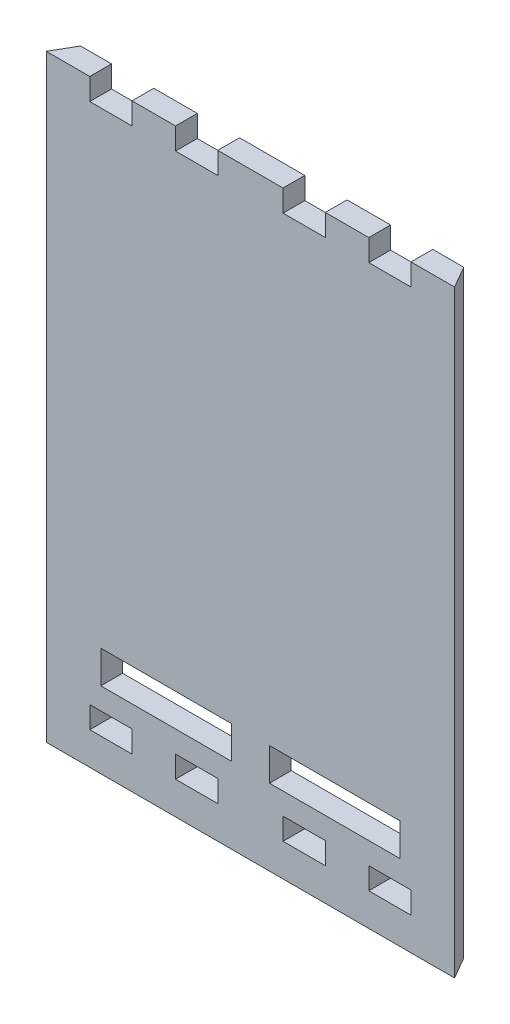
ISO-10303-21;
HEADER;
FILE_DESCRIPTION(('STEP AP214'),'2;1');
FILE_NAME('part.step','',(''),(''),'','','');
FILE_SCHEMA(('AUTOMOTIVE_DESIGN { 1 0 10303 214 1 1 1 1 }'));
ENDSEC;
DATA;
#1=APPLICATION_CONTEXT('core data for automotive mechanical design processes');
#2=APPLICATION_PROTOCOL_DEFINITION('international standard','automotive_design',2000,#1);
#3=PRODUCT_CONTEXT('',#1,'mechanical');
#4=PRODUCT('Part','Part','',(#3));
#5=PRODUCT_RELATED_PRODUCT_CATEGORY('part','',(#4));
#6=PRODUCT_DEFINITION_FORMATION('','',#4);
#7=PRODUCT_DEFINITION_CONTEXT('part definition',#1,'design');
#8=PRODUCT_DEFINITION('design','',#6,#7);
#9=PRODUCT_DEFINITION_SHAPE('','',#8);
#10=(LENGTH_UNIT() NAMED_UNIT(*) SI_UNIT(.MILLI.,.METRE.));
#11=(NAMED_UNIT(*) PLANE_ANGLE_UNIT() SI_UNIT($,.RADIAN.));
#12=(NAMED_UNIT(*) SI_UNIT($,.STERADIAN.) SOLID_ANGLE_UNIT());
#13=UNCERTAINTY_MEASURE_WITH_UNIT(LENGTH_MEASURE(1.E-05),#10,'distance_accuracy_value','');
#14=(GEOMETRIC_REPRESENTATION_CONTEXT(3) GLOBAL_UNCERTAINTY_ASSIGNED_CONTEXT((#13)) GLOBAL_UNIT_ASSIGNED_CONTEXT((#10,
#11,#12)) REPRESENTATION_CONTEXT('',''));
#15=CARTESIAN_POINT('',(0.,0.,0.));
#16=DIRECTION('',(0.,0.,1.));
#17=DIRECTION('',(1.,0.,0.));
#18=AXIS2_PLACEMENT_3D('',#15,#16,#17);
#19=CARTESIAN_POINT('',(0.,-2.,2.));
#20=DIRECTION('',(0.,1.,0.));
#21=DIRECTION('',(0.,0.,1.));
#22=AXIS2_PLACEMENT_3D('',#19,#20,#21);
#23=PLANE('',#22);
#24=DIRECTION('',(1.,0.,0.));
#25=VECTOR('',#24,1.);
#26=CARTESIAN_POINT('',(0.,-2.,0.));
#27=LINE('',#26,#25);
#28=CARTESIAN_POINT('',(3.99999999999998,-2.,0.));
#29=VERTEX_POINT('',#28);
#30=CARTESIAN_POINT('',(7.88194187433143,-2.,0.));
#31=VERTEX_POINT('',#30);
#32=EDGE_CURVE('E571',#29,#31,#27,.T.);
#33=ORIENTED_EDGE('',*,*,#32,.F.);
#34=DIRECTION('',(0.,0.,-1.));
#35=VECTOR('',#34,1.);
#36=CARTESIAN_POINT('',(3.99999999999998,-2.,2.));
#37=LINE('',#36,#35);
#38=CARTESIAN_POINT('',(3.99999999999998,-2.,2.));
#39=VERTEX_POINT('',#38);
#40=EDGE_CURVE('E11',#39,#29,#37,.T.);
#41=ORIENTED_EDGE('',*,*,#40,.F.);
#42=DIRECTION('',(1.,0.,0.));
#43=VECTOR('',#42,1.);
#44=CARTESIAN_POINT('',(0.,-2.,2.));
#45=LINE('',#44,#43);
#46=CARTESIAN_POINT('',(7.88194187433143,-2.,2.));
#47=VERTEX_POINT('',#46);
#48=EDGE_CURVE('E481',#39,#47,#45,.T.);
#49=ORIENTED_EDGE('',*,*,#48,.T.);
#50=DIRECTION('',(0.,0.,-1.));
#51=VECTOR('',#50,1.);
#52=CARTESIAN_POINT('',(7.88194187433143,-2.,2.));
#53=LINE('',#52,#51);
#54=EDGE_CURVE('E582',#47,#31,#53,.T.);
#55=ORIENTED_EDGE('',*,*,#54,.T.);
#56=EDGE_LOOP('',(#33,#41,#49,#55));
#57=FACE_BOUND('',#56,.T.);
#58=ADVANCED_FACE('F35',(#57),#23,.T.);
#59=CARTESIAN_POINT('',(3.99999999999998,0.,2.));
#60=DIRECTION('',(1.,0.,0.));
#61=DIRECTION('',(0.,1.,0.));
#62=AXIS2_PLACEMENT_3D('',#59,#60,#61);
#63=PLANE('',#62);
#64=DIRECTION('',(0.,-1.,0.));
#65=VECTOR('',#64,1.);
#66=CARTESIAN_POINT('',(3.99999999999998,0.,0.));
#67=LINE('',#66,#65);
#68=CARTESIAN_POINT('',(3.99999999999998,0.,0.));
#69=VERTEX_POINT('',#68);
#70=EDGE_CURVE('E574',#69,#29,#67,.T.);
#71=ORIENTED_EDGE('',*,*,#70,.F.);
#72=DIRECTION('',(0.,0.,-1.));
#73=VECTOR('',#72,1.);
#74=CARTESIAN_POINT('',(3.99999999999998,0.,2.));
#75=LINE('',#74,#73);
#76=CARTESIAN_POINT('',(3.99999999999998,0.,2.));
#77=VERTEX_POINT('',#76);
#78=EDGE_CURVE('E44',#77,#69,#75,.T.);
#79=ORIENTED_EDGE('',*,*,#78,.F.);
#80=DIRECTION('',(0.,-1.,0.));
#81=VECTOR('',#80,1.);
#82=CARTESIAN_POINT('',(3.99999999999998,0.,2.));
#83=LINE('',#82,#81);
#84=EDGE_CURVE('E484',#77,#39,#83,.T.);
#85=ORIENTED_EDGE('',*,*,#84,.T.);
#86=ORIENTED_EDGE('',*,*,#40,.T.);
#87=EDGE_LOOP('',(#71,#79,#85,#86));
#88=FACE_BOUND('',#87,.T.);
#89=ADVANCED_FACE('F747',(#88),#63,.T.);
#90=CARTESIAN_POINT('',(0.,0.,2.));
#91=DIRECTION('',(0.,1.,0.));
#92=DIRECTION('',(0.,0.,1.));
#93=AXIS2_PLACEMENT_3D('',#90,#91,#92);
#94=PLANE('',#93);
#95=DIRECTION('',(1.,0.,0.));
#96=VECTOR('',#95,1.);
#97=CARTESIAN_POINT('',(0.,0.,0.));
#98=LINE('',#97,#96);
#99=CARTESIAN_POINT('',(7.88194187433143,0.,0.));
#100=VERTEX_POINT('',#99);
#101=EDGE_CURVE('E577',#69,#100,#98,.T.);
#102=ORIENTED_EDGE('',*,*,#101,.T.);
#103=DIRECTION('',(0.,0.,-1.));
#104=VECTOR('',#103,1.);
#105=CARTESIAN_POINT('',(7.88194187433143,0.,2.));
#106=LINE('',#105,#104);
#107=CARTESIAN_POINT('',(7.88194187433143,0.,2.));
#108=VERTEX_POINT('',#107);
#109=EDGE_CURVE('E584',#108,#100,#106,.T.);
#110=ORIENTED_EDGE('',*,*,#109,.F.);
#111=DIRECTION('',(1.,0.,0.));
#112=VECTOR('',#111,1.);
#113=CARTESIAN_POINT('',(0.,0.,2.));
#114=LINE('',#113,#112);
#115=EDGE_CURVE('E487',#77,#108,#114,.T.);
#116=ORIENTED_EDGE('',*,*,#115,.F.);
#117=ORIENTED_EDGE('',*,*,#78,.T.);
#118=EDGE_LOOP('',(#102,#110,#116,#117));
#119=FACE_BOUND('',#118,.T.);
#120=ADVANCED_FACE('F753',(#119),#94,.F.);
#121=CARTESIAN_POINT('',(0.,-2.,2.));
#122=DIRECTION('',(0.,1.,0.));
#123=DIRECTION('',(0.,0.,1.));
#124=AXIS2_PLACEMENT_3D('',#121,#122,#123);
#125=PLANE('',#124);
#126=DIRECTION('',(1.,0.,0.));
#127=VECTOR('',#126,1.);
#128=CARTESIAN_POINT('',(0.,-2.,0.));
#129=LINE('',#128,#127);
#130=CARTESIAN_POINT('',(11.8819418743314,-2.,0.));
#131=VERTEX_POINT('',#130);
#132=CARTESIAN_POINT('',(15.7638837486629,-2.,0.));
#133=VERTEX_POINT('',#132);
#134=EDGE_CURVE('E559',#131,#133,#129,.T.);
#135=ORIENTED_EDGE('',*,*,#134,.F.);
#136=DIRECTION('',(0.,0.,-1.));
#137=VECTOR('',#136,1.);
#138=CARTESIAN_POINT('',(11.8819418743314,-2.,2.));
#139=LINE('',#138,#137);
#140=CARTESIAN_POINT('',(11.8819418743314,-2.,2.));
#141=VERTEX_POINT('',#140);
#142=EDGE_CURVE('E585',#141,#131,#139,.T.);
#143=ORIENTED_EDGE('',*,*,#142,.F.);
#144=DIRECTION('',(1.,0.,0.));
#145=VECTOR('',#144,1.);
#146=CARTESIAN_POINT('',(0.,-2.,2.));
#147=LINE('',#146,#145);
#148=CARTESIAN_POINT('',(15.7638837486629,-2.,2.));
#149=VERTEX_POINT('',#148);
#150=EDGE_CURVE('E470',#141,#149,#147,.T.);
#151=ORIENTED_EDGE('',*,*,#150,.T.);
#152=DIRECTION('',(0.,0.,-1.));
#153=VECTOR('',#152,1.);
#154=CARTESIAN_POINT('',(15.7638837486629,-2.,2.));
#155=LINE('',#154,#153);
#156=EDGE_CURVE('E589',#149,#133,#155,.T.);
#157=ORIENTED_EDGE('',*,*,#156,.T.);
#158=EDGE_LOOP('',(#135,#143,#151,#157));
#159=FACE_BOUND('',#158,.T.);
#160=ADVANCED_FACE('F767',(#159),#125,.T.);
#161=CARTESIAN_POINT('',(11.8819418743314,0.,2.));
#162=DIRECTION('',(1.,0.,0.));
#163=DIRECTION('',(0.,1.,0.));
#164=AXIS2_PLACEMENT_3D('',#161,#162,#163);
#165=PLANE('',#164);
#166=DIRECTION('',(0.,-1.,0.));
#167=VECTOR('',#166,1.);
#168=CARTESIAN_POINT('',(11.8819418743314,0.,0.));
#169=LINE('',#168,#167);
#170=CARTESIAN_POINT('',(11.8819418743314,0.,0.));
#171=VERTEX_POINT('',#170);
#172=EDGE_CURVE('E562',#171,#131,#169,.T.);
#173=ORIENTED_EDGE('',*,*,#172,.F.);
#174=DIRECTION('',(0.,0.,-1.));
#175=VECTOR('',#174,1.);
#176=CARTESIAN_POINT('',(11.8819418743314,0.,2.));
#177=LINE('',#176,#175);
#178=CARTESIAN_POINT('',(11.8819418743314,0.,2.));
#179=VERTEX_POINT('',#178);
#180=EDGE_CURVE('E595',#179,#171,#177,.T.);
#181=ORIENTED_EDGE('',*,*,#180,.F.);
#182=DIRECTION('',(0.,-1.,0.));
#183=VECTOR('',#182,1.);
#184=CARTESIAN_POINT('',(11.8819418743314,0.,2.));
#185=LINE('',#184,#183);
#186=EDGE_CURVE('E473',#179,#141,#185,.T.);
#187=ORIENTED_EDGE('',*,*,#186,.T.);
#188=ORIENTED_EDGE('',*,*,#142,.T.);
#189=EDGE_LOOP('',(#173,#181,#187,#188));
#190=FACE_BOUND('',#189,.T.);
#191=ADVANCED_FACE('F763',(#190),#165,.T.);
#192=CARTESIAN_POINT('',(0.,0.,2.));
#193=DIRECTION('',(0.,1.,0.));
#194=DIRECTION('',(0.,0.,1.));
#195=AXIS2_PLACEMENT_3D('',#192,#193,#194);
#196=PLANE('',#195);
#197=DIRECTION('',(1.,0.,0.));
#198=VECTOR('',#197,1.);
#199=CARTESIAN_POINT('',(0.,0.,0.));
#200=LINE('',#199,#198);
#201=CARTESIAN_POINT('',(15.7638837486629,0.,0.));
#202=VERTEX_POINT('',#201);
#203=EDGE_CURVE('E565',#171,#202,#200,.T.);
#204=ORIENTED_EDGE('',*,*,#203,.T.);
#205=DIRECTION('',(0.,0.,-1.));
#206=VECTOR('',#205,1.);
#207=CARTESIAN_POINT('',(15.7638837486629,0.,2.));
#208=LINE('',#207,#206);
#209=CARTESIAN_POINT('',(15.7638837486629,0.,2.));
#210=VERTEX_POINT('',#209);
#211=EDGE_CURVE('E591',#210,#202,#208,.T.);
#212=ORIENTED_EDGE('',*,*,#211,.F.);
#213=DIRECTION('',(1.,0.,0.));
#214=VECTOR('',#213,1.);
#215=CARTESIAN_POINT('',(0.,0.,2.));
#216=LINE('',#215,#214);
#217=EDGE_CURVE('E476',#179,#210,#216,.T.);
#218=ORIENTED_EDGE('',*,*,#217,.F.);
#219=ORIENTED_EDGE('',*,*,#180,.T.);
#220=EDGE_LOOP('',(#204,#212,#218,#219));
#221=FACE_BOUND('',#220,.T.);
#222=ADVANCED_FACE('F759',(#221),#196,.F.);
#223=CARTESIAN_POINT('',(0.,-2.,2.));
#224=DIRECTION('',(0.,1.,0.));
#225=DIRECTION('',(0.,0.,1.));
#226=AXIS2_PLACEMENT_3D('',#223,#224,#225);
#227=PLANE('',#226);
#228=DIRECTION('',(1.,0.,0.));
#229=VECTOR('',#228,1.);
#230=CARTESIAN_POINT('',(0.,-2.,0.));
#231=LINE('',#230,#229);
#232=CARTESIAN_POINT('',(21.7638837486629,-2.,0.));
#233=VERTEX_POINT('',#232);
#234=CARTESIAN_POINT('',(25.6458256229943,-2.,0.));
#235=VERTEX_POINT('',#234);
#236=EDGE_CURVE('E547',#233,#235,#231,.T.);
#237=ORIENTED_EDGE('',*,*,#236,.F.);
#238=DIRECTION('',(0.,0.,-1.));
#239=VECTOR('',#238,1.);
#240=CARTESIAN_POINT('',(21.7638837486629,-2.,2.));
#241=LINE('',#240,#239);
#242=CARTESIAN_POINT('',(21.7638837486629,-2.,2.));
#243=VERTEX_POINT('',#242);
#244=EDGE_CURVE('E592',#243,#233,#241,.T.);
#245=ORIENTED_EDGE('',*,*,#244,.F.);
#246=DIRECTION('',(1.,0.,0.));
#247=VECTOR('',#246,1.);
#248=CARTESIAN_POINT('',(0.,-2.,2.));
#249=LINE('',#248,#247);
#250=CARTESIAN_POINT('',(25.6458256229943,-2.,2.));
#251=VERTEX_POINT('',#250);
#252=EDGE_CURVE('E459',#243,#251,#249,.T.);
#253=ORIENTED_EDGE('',*,*,#252,.T.);
#254=DIRECTION('',(0.,0.,-1.));
#255=VECTOR('',#254,1.);
#256=CARTESIAN_POINT('',(25.6458256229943,-2.,2.));
#257=LINE('',#256,#255);
#258=EDGE_CURVE('E598',#251,#235,#257,.T.);
#259=ORIENTED_EDGE('',*,*,#258,.T.);
#260=EDGE_LOOP('',(#237,#245,#253,#259));
#261=FACE_BOUND('',#260,.T.);
#262=ADVANCED_FACE('F762',(#261),#227,.T.);
#263=CARTESIAN_POINT('',(21.7638837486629,0.,2.));
#264=DIRECTION('',(1.,0.,0.));
#265=DIRECTION('',(0.,0.,-1.));
#266=AXIS2_PLACEMENT_3D('',#263,#264,#265);
#267=PLANE('',#266);
#268=DIRECTION('',(0.,-1.,0.));
#269=VECTOR('',#268,1.);
#270=CARTESIAN_POINT('',(21.7638837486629,0.,0.));
#271=LINE('',#270,#269);
#272=CARTESIAN_POINT('',(21.7638837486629,0.,0.));
#273=VERTEX_POINT('',#272);
#274=EDGE_CURVE('E550',#273,#233,#271,.T.);
#275=ORIENTED_EDGE('',*,*,#274,.F.);
#276=DIRECTION('',(0.,0.,-1.));
#277=VECTOR('',#276,1.);
#278=CARTESIAN_POINT('',(21.7638837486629,0.,2.));
#279=LINE('',#278,#277);
#280=CARTESIAN_POINT('',(21.7638837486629,0.,2.));
#281=VERTEX_POINT('',#280);
#282=EDGE_CURVE('E603',#281,#273,#279,.T.);
#283=ORIENTED_EDGE('',*,*,#282,.F.);
#284=DIRECTION('',(0.,-1.,0.));
#285=VECTOR('',#284,1.);
#286=CARTESIAN_POINT('',(21.7638837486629,0.,2.));
#287=LINE('',#286,#285);
#288=EDGE_CURVE('E462',#281,#243,#287,.T.);
#289=ORIENTED_EDGE('',*,*,#288,.T.);
#290=ORIENTED_EDGE('',*,*,#244,.T.);
#291=EDGE_LOOP('',(#275,#283,#289,#290));
#292=FACE_BOUND('',#291,.T.);
#293=ADVANCED_FACE('F780',(#292),#267,.T.);
#294=CARTESIAN_POINT('',(0.,0.,2.));
#295=DIRECTION('',(0.,-1.,0.));
#296=DIRECTION('',(0.,0.,-1.));
#297=AXIS2_PLACEMENT_3D('',#294,#295,#296);
#298=PLANE('',#297);
#299=DIRECTION('',(-1.,0.,0.));
#300=VECTOR('',#299,1.);
#301=CARTESIAN_POINT('',(0.,0.,0.));
#302=LINE('',#301,#300);
#303=CARTESIAN_POINT('',(25.6458256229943,0.,0.));
#304=VERTEX_POINT('',#303);
#305=EDGE_CURVE('E553',#304,#273,#302,.T.);
#306=ORIENTED_EDGE('',*,*,#305,.F.);
#307=DIRECTION('',(0.,0.,-1.));
#308=VECTOR('',#307,1.);
#309=CARTESIAN_POINT('',(25.6458256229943,0.,2.));
#310=LINE('',#309,#308);
#311=CARTESIAN_POINT('',(25.6458256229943,0.,2.));
#312=VERTEX_POINT('',#311);
#313=EDGE_CURVE('E600',#312,#304,#310,.T.);
#314=ORIENTED_EDGE('',*,*,#313,.F.);
#315=DIRECTION('',(-1.,0.,0.));
#316=VECTOR('',#315,1.);
#317=CARTESIAN_POINT('',(0.,0.,2.));
#318=LINE('',#317,#316);
#319=EDGE_CURVE('E465',#312,#281,#318,.T.);
#320=ORIENTED_EDGE('',*,*,#319,.T.);
#321=ORIENTED_EDGE('',*,*,#282,.T.);
#322=EDGE_LOOP('',(#306,#314,#320,#321));
#323=FACE_BOUND('',#322,.T.);
#324=ADVANCED_FACE('F776',(#323),#298,.T.);
#325=CARTESIAN_POINT('',(0.,-2.,2.));
#326=DIRECTION('',(0.,1.,0.));
#327=DIRECTION('',(0.,0.,1.));
#328=AXIS2_PLACEMENT_3D('',#325,#326,#327);
#329=PLANE('',#328);
#330=DIRECTION('',(1.,0.,0.));
#331=VECTOR('',#330,1.);
#332=CARTESIAN_POINT('',(0.,-2.,0.));
#333=LINE('',#332,#331);
#334=CARTESIAN_POINT('',(29.6458256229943,-2.,0.));
#335=VERTEX_POINT('',#334);
#336=CARTESIAN_POINT('',(33.5277674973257,-2.,0.));
#337=VERTEX_POINT('',#336);
#338=EDGE_CURVE('E535',#335,#337,#333,.T.);
#339=ORIENTED_EDGE('',*,*,#338,.F.);
#340=DIRECTION('',(0.,0.,-1.));
#341=VECTOR('',#340,1.);
#342=CARTESIAN_POINT('',(29.6458256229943,-2.,2.));
#343=LINE('',#342,#341);
#344=CARTESIAN_POINT('',(29.6458256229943,-2.,2.));
#345=VERTEX_POINT('',#344);
#346=EDGE_CURVE('E601',#345,#335,#343,.T.);
#347=ORIENTED_EDGE('',*,*,#346,.F.);
#348=DIRECTION('',(1.,0.,0.));
#349=VECTOR('',#348,1.);
#350=CARTESIAN_POINT('',(0.,-2.,2.));
#351=LINE('',#350,#349);
#352=CARTESIAN_POINT('',(33.5277674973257,-2.,2.));
#353=VERTEX_POINT('',#352);
#354=EDGE_CURVE('E448',#345,#353,#351,.T.);
#355=ORIENTED_EDGE('',*,*,#354,.T.);
#356=DIRECTION('',(0.,0.,-1.));
#357=VECTOR('',#356,1.);
#358=CARTESIAN_POINT('',(33.5277674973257,-2.,2.));
#359=LINE('',#358,#357);
#360=EDGE_CURVE('E606',#353,#337,#359,.T.);
#361=ORIENTED_EDGE('',*,*,#360,.T.);
#362=EDGE_LOOP('',(#339,#347,#355,#361));
#363=FACE_BOUND('',#362,.T.);
#364=ADVANCED_FACE('F779',(#363),#329,.T.);
#365=CARTESIAN_POINT('',(29.6458256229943,0.,2.));
#366=DIRECTION('',(1.,0.,0.));
#367=DIRECTION('',(0.,0.,-1.));
#368=AXIS2_PLACEMENT_3D('',#365,#366,#367);
#369=PLANE('',#368);
#370=DIRECTION('',(0.,-1.,0.));
#371=VECTOR('',#370,1.);
#372=CARTESIAN_POINT('',(29.6458256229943,0.,0.));
#373=LINE('',#372,#371);
#374=CARTESIAN_POINT('',(29.6458256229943,0.,0.));
#375=VERTEX_POINT('',#374);
#376=EDGE_CURVE('E538',#375,#335,#373,.T.);
#377=ORIENTED_EDGE('',*,*,#376,.F.);
#378=DIRECTION('',(0.,0.,-1.));
#379=VECTOR('',#378,1.);
#380=CARTESIAN_POINT('',(29.6458256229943,0.,2.));
#381=LINE('',#380,#379);
#382=CARTESIAN_POINT('',(29.6458256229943,0.,2.));
#383=VERTEX_POINT('',#382);
#384=EDGE_CURVE('E610',#383,#375,#381,.T.);
#385=ORIENTED_EDGE('',*,*,#384,.F.);
#386=DIRECTION('',(0.,-1.,0.));
#387=VECTOR('',#386,1.);
#388=CARTESIAN_POINT('',(29.6458256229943,0.,2.));
#389=LINE('',#388,#387);
#390=EDGE_CURVE('E451',#383,#345,#389,.T.);
#391=ORIENTED_EDGE('',*,*,#390,.T.);
#392=ORIENTED_EDGE('',*,*,#346,.T.);
#393=EDGE_LOOP('',(#377,#385,#391,#392));
#394=FACE_BOUND('',#393,.T.);
#395=ADVANCED_FACE('F794',(#394),#369,.T.);
#396=CARTESIAN_POINT('',(0.,0.,2.));
#397=DIRECTION('',(0.,-1.,0.));
#398=DIRECTION('',(0.,0.,-1.));
#399=AXIS2_PLACEMENT_3D('',#396,#397,#398);
#400=PLANE('',#399);
#401=DIRECTION('',(-1.,0.,0.));
#402=VECTOR('',#401,1.);
#403=CARTESIAN_POINT('',(0.,0.,0.));
#404=LINE('',#403,#402);
#405=CARTESIAN_POINT('',(33.5277674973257,0.,0.));
#406=VERTEX_POINT('',#405);
#407=EDGE_CURVE('E541',#406,#375,#404,.T.);
#408=ORIENTED_EDGE('',*,*,#407,.F.);
#409=DIRECTION('',(0.,0.,-1.));
#410=VECTOR('',#409,1.);
#411=CARTESIAN_POINT('',(33.5277674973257,0.,2.));
#412=LINE('',#411,#410);
#413=CARTESIAN_POINT('',(33.5277674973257,0.,2.));
#414=VERTEX_POINT('',#413);
#415=EDGE_CURVE('E608',#414,#406,#412,.T.);
#416=ORIENTED_EDGE('',*,*,#415,.F.);
#417=DIRECTION('',(-1.,0.,0.));
#418=VECTOR('',#417,1.);
#419=CARTESIAN_POINT('',(0.,0.,2.));
#420=LINE('',#419,#418);
#421=EDGE_CURVE('E454',#414,#383,#420,.T.);
#422=ORIENTED_EDGE('',*,*,#421,.T.);
#423=ORIENTED_EDGE('',*,*,#384,.T.);
#424=EDGE_LOOP('',(#408,#416,#422,#423));
#425=FACE_BOUND('',#424,.T.);
#426=ADVANCED_FACE('F791',(#425),#400,.T.);
#427=CARTESIAN_POINT('',(0.,48.,2.));
#428=DIRECTION('',(0.,1.,0.));
#429=DIRECTION('',(0.,0.,1.));
#430=AXIS2_PLACEMENT_3D('',#427,#428,#429);
#431=PLANE('',#430);
#432=DIRECTION('',(1.,0.,0.));
#433=VECTOR('',#432,1.);
#434=CARTESIAN_POINT('',(0.,48.,0.));
#435=LINE('',#434,#433);
#436=CARTESIAN_POINT('',(3.99999999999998,48.,0.));
#437=VERTEX_POINT('',#436);
#438=CARTESIAN_POINT('',(7.88194187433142,48.,0.));
#439=VERTEX_POINT('',#438);
#440=EDGE_CURVE('E395',#437,#439,#435,.T.);
#441=ORIENTED_EDGE('',*,*,#440,.F.);
#442=DIRECTION('',(0.,0.,-1.));
#443=VECTOR('',#442,1.);
#444=CARTESIAN_POINT('',(3.99999999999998,48.,2.));
#445=LINE('',#444,#443);
#446=CARTESIAN_POINT('',(3.99999999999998,48.,2.));
#447=VERTEX_POINT('',#446);
#448=EDGE_CURVE('E39',#447,#437,#445,.T.);
#449=ORIENTED_EDGE('',*,*,#448,.F.);
#450=DIRECTION('',(1.,0.,0.));
#451=VECTOR('',#450,1.);
#452=CARTESIAN_POINT('',(0.,48.,2.));
#453=LINE('',#452,#451);
#454=CARTESIAN_POINT('',(7.88194187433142,48.,2.));
#455=VERTEX_POINT('',#454);
#456=EDGE_CURVE('E402',#447,#455,#453,.T.);
#457=ORIENTED_EDGE('',*,*,#456,.T.);
#458=DIRECTION('',(0.,0.,-1.));
#459=VECTOR('',#458,1.);
#460=CARTESIAN_POINT('',(7.88194187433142,48.,2.));
#461=LINE('',#460,#459);
#462=EDGE_CURVE('E492',#455,#439,#461,.T.);
#463=ORIENTED_EDGE('',*,*,#462,.T.);
#464=EDGE_LOOP('',(#441,#449,#457,#463));
#465=FACE_BOUND('',#464,.T.);
#466=ADVANCED_FACE('F37',(#465),#431,.T.);
#467=CARTESIAN_POINT('',(3.99999999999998,0.,2.));
#468=DIRECTION('',(-1.,0.,0.));
#469=DIRECTION('',(0.,0.,1.));
#470=AXIS2_PLACEMENT_3D('',#467,#468,#469);
#471=PLANE('',#470);
#472=DIRECTION('',(0.,1.,0.));
#473=VECTOR('',#472,1.);
#474=CARTESIAN_POINT('',(3.99999999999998,0.,0.));
#475=LINE('',#474,#473);
#476=CARTESIAN_POINT('',(3.99999999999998,50.,0.));
#477=VERTEX_POINT('',#476);
#478=EDGE_CURVE('E495',#437,#477,#475,.T.);
#479=ORIENTED_EDGE('',*,*,#478,.T.);
#480=DIRECTION('',(0.,0.,-1.));
#481=VECTOR('',#480,1.);
#482=CARTESIAN_POINT('',(3.99999999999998,50.,2.));
#483=LINE('',#482,#481);
#484=CARTESIAN_POINT('',(3.99999999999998,50.,2.));
#485=VERTEX_POINT('',#484);
#486=EDGE_CURVE('E641',#485,#477,#483,.T.);
#487=ORIENTED_EDGE('',*,*,#486,.F.);
#488=DIRECTION('',(0.,1.,0.));
#489=VECTOR('',#488,1.);
#490=CARTESIAN_POINT('',(3.99999999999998,0.,2.));
#491=LINE('',#490,#489);
#492=EDGE_CURVE('E405',#447,#485,#491,.T.);
#493=ORIENTED_EDGE('',*,*,#492,.F.);
#494=ORIENTED_EDGE('',*,*,#448,.T.);
#495=EDGE_LOOP('',(#479,#487,#493,#494));
#496=FACE_BOUND('',#495,.T.);
#497=ADVANCED_FACE('F649',(#496),#471,.F.);
#498=CARTESIAN_POINT('',(0.,50.,2.));
#499=DIRECTION('',(0.,1.,0.));
#500=DIRECTION('',(0.,0.,1.));
#501=AXIS2_PLACEMENT_3D('',#498,#499,#500);
#502=PLANE('',#501);
#503=DIRECTION('',(0.499999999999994,0.,-0.866025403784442));
#504=VECTOR('',#503,1.);
#505=CARTESIAN_POINT('',(1.15470053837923,50.,0.));
#506=LINE('',#505,#504);
#507=CARTESIAN_POINT('',(0.,50.,2.));
#508=VERTEX_POINT('',#507);
#509=CARTESIAN_POINT('',(1.15470053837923,50.,0.));
#510=VERTEX_POINT('',#509);
#511=EDGE_CURVE('E354',#508,#510,#506,.T.);
#512=ORIENTED_EDGE('',*,*,#511,.F.);
#513=DIRECTION('',(1.,0.,0.));
#514=VECTOR('',#513,1.);
#515=CARTESIAN_POINT('',(0.,50.,2.));
#516=LINE('',#515,#514);
#517=EDGE_CURVE('E408',#508,#485,#516,.T.);
#518=ORIENTED_EDGE('',*,*,#517,.T.);
#519=ORIENTED_EDGE('',*,*,#486,.T.);
#520=DIRECTION('',(1.,0.,0.));
#521=VECTOR('',#520,1.);
#522=CARTESIAN_POINT('',(0.,50.,0.));
#523=LINE('',#522,#521);
#524=EDGE_CURVE('E498',#510,#477,#523,.T.);
#525=ORIENTED_EDGE('',*,*,#524,.F.);
#526=EDGE_LOOP('',(#512,#518,#519,#525));
#527=FACE_BOUND('',#526,.T.);
#528=ADVANCED_FACE('F694',(#527),#502,.T.);
#529=CARTESIAN_POINT('',(0.,-5.,2.));
#530=DIRECTION('',(0.,1.,0.));
#531=DIRECTION('',(0.,0.,1.));
#532=AXIS2_PLACEMENT_3D('',#529,#530,#531);
#533=PLANE('',#532);
#534=DIRECTION('',(1.,0.,0.));
#535=VECTOR('',#534,1.);
#536=CARTESIAN_POINT('',(0.,-5.,0.));
#537=LINE('',#536,#535);
#538=CARTESIAN_POINT('',(1.15470053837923,-5.,0.));
#539=VERTEX_POINT('',#538);
#540=CARTESIAN_POINT('',(36.3730669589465,-5.,0.));
#541=VERTEX_POINT('',#540);
#542=EDGE_CURVE('E500',#539,#541,#537,.T.);
#543=ORIENTED_EDGE('',*,*,#542,.T.);
#544=DIRECTION('',(0.499999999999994,0.,0.866025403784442));
#545=VECTOR('',#544,1.);
#546=CARTESIAN_POINT('',(36.3730669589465,-5.,0.));
#547=LINE('',#546,#545);
#548=CARTESIAN_POINT('',(37.5277674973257,-5.,2.));
#549=VERTEX_POINT('',#548);
#550=EDGE_CURVE('E387',#541,#549,#547,.T.);
#551=ORIENTED_EDGE('',*,*,#550,.T.);
#552=DIRECTION('',(1.,0.,0.));
#553=VECTOR('',#552,1.);
#554=CARTESIAN_POINT('',(0.,-5.,2.));
#555=LINE('',#554,#553);
#556=CARTESIAN_POINT('',(0.,-5.,2.));
#557=VERTEX_POINT('',#556);
#558=EDGE_CURVE('E415',#557,#549,#555,.T.);
#559=ORIENTED_EDGE('',*,*,#558,.F.);
#560=DIRECTION('',(0.499999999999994,0.,-0.866025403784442));
#561=VECTOR('',#560,1.);
#562=CARTESIAN_POINT('',(1.15470053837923,-5.,0.));
#563=LINE('',#562,#561);
#564=EDGE_CURVE('E396',#557,#539,#563,.T.);
#565=ORIENTED_EDGE('',*,*,#564,.T.);
#566=EDGE_LOOP('',(#543,#551,#559,#565));
#567=FACE_BOUND('',#566,.T.);
#568=ADVANCED_FACE('F691',(#567),#533,.F.);
#569=DIRECTION('',(0.499999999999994,0.,0.866025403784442));
#570=VECTOR('',#569,1.);
#571=CARTESIAN_POINT('',(36.3730669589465,50.,0.));
#572=LINE('',#571,#570);
#573=CARTESIAN_POINT('',(36.3730669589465,50.,0.));
#574=VERTEX_POINT('',#573);
#575=CARTESIAN_POINT('',(37.5277674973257,50.,2.));
#576=VERTEX_POINT('',#575);
#577=EDGE_CURVE('E391',#574,#576,#572,.T.);
#578=ORIENTED_EDGE('',*,*,#577,.F.);
#579=CARTESIAN_POINT('',(33.5277674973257,50.,0.));
#580=VERTEX_POINT('',#579);
#581=EDGE_CURVE('E502',#580,#574,#523,.T.);
#582=ORIENTED_EDGE('',*,*,#581,.F.);
#583=DIRECTION('',(0.,0.,-1.));
#584=VECTOR('',#583,1.);
#585=CARTESIAN_POINT('',(33.5277674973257,50.,2.));
#586=LINE('',#585,#584);
#587=CARTESIAN_POINT('',(33.5277674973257,50.,2.));
#588=VERTEX_POINT('',#587);
#589=EDGE_CURVE('E640',#588,#580,#586,.T.);
#590=ORIENTED_EDGE('',*,*,#589,.F.);
#591=EDGE_CURVE('E413',#588,#576,#516,.T.);
#592=ORIENTED_EDGE('',*,*,#591,.T.);
#593=EDGE_LOOP('',(#578,#582,#590,#592));
#594=FACE_BOUND('',#593,.T.);
#595=ADVANCED_FACE('F678',(#594),#502,.T.);
#596=CARTESIAN_POINT('',(33.5277674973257,0.,2.));
#597=DIRECTION('',(-1.,0.,0.));
#598=DIRECTION('',(0.,0.,1.));
#599=AXIS2_PLACEMENT_3D('',#596,#597,#598);
#600=PLANE('',#599);
#601=DIRECTION('',(0.,1.,0.));
#602=VECTOR('',#601,1.);
#603=CARTESIAN_POINT('',(33.5277674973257,0.,0.));
#604=LINE('',#603,#602);
#605=CARTESIAN_POINT('',(33.5277674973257,48.,0.));
#606=VERTEX_POINT('',#605);
#607=EDGE_CURVE('E505',#606,#580,#604,.T.);
#608=ORIENTED_EDGE('',*,*,#607,.F.);
#609=DIRECTION('',(0.,0.,-1.));
#610=VECTOR('',#609,1.);
#611=CARTESIAN_POINT('',(33.5277674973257,48.,2.));
#612=LINE('',#611,#610);
#613=CARTESIAN_POINT('',(33.5277674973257,48.,2.));
#614=VERTEX_POINT('',#613);
#615=EDGE_CURVE('E638',#614,#606,#612,.T.);
#616=ORIENTED_EDGE('',*,*,#615,.F.);
#617=DIRECTION('',(0.,1.,0.));
#618=VECTOR('',#617,1.);
#619=CARTESIAN_POINT('',(33.5277674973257,0.,2.));
#620=LINE('',#619,#618);
#621=EDGE_CURVE('E421',#614,#588,#620,.T.);
#622=ORIENTED_EDGE('',*,*,#621,.T.);
#623=ORIENTED_EDGE('',*,*,#589,.T.);
#624=EDGE_LOOP('',(#608,#616,#622,#623));
#625=FACE_BOUND('',#624,.T.);
#626=ADVANCED_FACE('F1032',(#625),#600,.T.);
#627=CARTESIAN_POINT('',(0.,48.,2.));
#628=DIRECTION('',(0.,-1.,0.));
#629=DIRECTION('',(0.,0.,-1.));
#630=AXIS2_PLACEMENT_3D('',#627,#628,#629);
#631=PLANE('',#630);
#632=DIRECTION('',(-1.,0.,0.));
#633=VECTOR('',#632,1.);
#634=CARTESIAN_POINT('',(0.,48.,0.));
#635=LINE('',#634,#633);
#636=CARTESIAN_POINT('',(29.6458256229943,48.,0.));
#637=VERTEX_POINT('',#636);
#638=EDGE_CURVE('E508',#606,#637,#635,.T.);
#639=ORIENTED_EDGE('',*,*,#638,.T.);
#640=DIRECTION('',(0.,0.,-1.));
#641=VECTOR('',#640,1.);
#642=CARTESIAN_POINT('',(29.6458256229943,48.,2.));
#643=LINE('',#642,#641);
#644=CARTESIAN_POINT('',(29.6458256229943,48.,2.));
#645=VERTEX_POINT('',#644);
#646=EDGE_CURVE('E635',#645,#637,#643,.T.);
#647=ORIENTED_EDGE('',*,*,#646,.F.);
#648=DIRECTION('',(-1.,0.,0.));
#649=VECTOR('',#648,1.);
#650=CARTESIAN_POINT('',(0.,48.,2.));
#651=LINE('',#650,#649);
#652=EDGE_CURVE('E424',#614,#645,#651,.T.);
#653=ORIENTED_EDGE('',*,*,#652,.F.);
#654=ORIENTED_EDGE('',*,*,#615,.T.);
#655=EDGE_LOOP('',(#639,#647,#653,#654));
#656=FACE_BOUND('',#655,.T.);
#657=ADVANCED_FACE('F1023',(#656),#631,.F.);
#658=CARTESIAN_POINT('',(29.6458256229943,0.,2.));
#659=DIRECTION('',(-1.,0.,0.));
#660=DIRECTION('',(0.,0.,1.));
#661=AXIS2_PLACEMENT_3D('',#658,#659,#660);
#662=PLANE('',#661);
#663=DIRECTION('',(0.,1.,0.));
#664=VECTOR('',#663,1.);
#665=CARTESIAN_POINT('',(29.6458256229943,0.,0.));
#666=LINE('',#665,#664);
#667=CARTESIAN_POINT('',(29.6458256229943,50.,0.));
#668=VERTEX_POINT('',#667);
#669=EDGE_CURVE('E510',#637,#668,#666,.T.);
#670=ORIENTED_EDGE('',*,*,#669,.T.);
#671=DIRECTION('',(0.,0.,-1.));
#672=VECTOR('',#671,1.);
#673=CARTESIAN_POINT('',(29.6458256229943,50.,2.));
#674=LINE('',#673,#672);
#675=CARTESIAN_POINT('',(29.6458256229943,50.,2.));
#676=VERTEX_POINT('',#675);
#677=EDGE_CURVE('E633',#676,#668,#674,.T.);
#678=ORIENTED_EDGE('',*,*,#677,.F.);
#679=DIRECTION('',(0.,1.,0.));
#680=VECTOR('',#679,1.);
#681=CARTESIAN_POINT('',(29.6458256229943,0.,2.));
#682=LINE('',#681,#680);
#683=EDGE_CURVE('E426',#645,#676,#682,.T.);
#684=ORIENTED_EDGE('',*,*,#683,.F.);
#685=ORIENTED_EDGE('',*,*,#646,.T.);
#686=EDGE_LOOP('',(#670,#678,#684,#685));
#687=FACE_BOUND('',#686,.T.);
#688=ADVANCED_FACE('F1016',(#687),#662,.F.);
#689=CARTESIAN_POINT('',(25.6458256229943,50.,0.));
#690=VERTEX_POINT('',#689);
#691=EDGE_CURVE('E513',#690,#668,#523,.T.);
#692=ORIENTED_EDGE('',*,*,#691,.F.);
#693=DIRECTION('',(0.,0.,-1.));
#694=VECTOR('',#693,1.);
#695=CARTESIAN_POINT('',(25.6458256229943,50.,2.));
#696=LINE('',#695,#694);
#697=CARTESIAN_POINT('',(25.6458256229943,50.,2.));
#698=VERTEX_POINT('',#697);
#699=EDGE_CURVE('E631',#698,#690,#696,.T.);
#700=ORIENTED_EDGE('',*,*,#699,.F.);
#701=EDGE_CURVE('E428',#698,#676,#516,.T.);
#702=ORIENTED_EDGE('',*,*,#701,.T.);
#703=ORIENTED_EDGE('',*,*,#677,.T.);
#704=EDGE_LOOP('',(#692,#700,#702,#703));
#705=FACE_BOUND('',#704,.T.);
#706=ADVANCED_FACE('F706',(#705),#502,.T.);
#707=CARTESIAN_POINT('',(25.6458256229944,0.,2.));
#708=DIRECTION('',(-1.,0.,0.));
#709=DIRECTION('',(0.,-1.,0.));
#710=AXIS2_PLACEMENT_3D('',#707,#708,#709);
#711=PLANE('',#710);
#712=DIRECTION('',(0.,1.,0.));
#713=VECTOR('',#712,1.);
#714=CARTESIAN_POINT('',(25.6458256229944,0.,0.));
#715=LINE('',#714,#713);
#716=CARTESIAN_POINT('',(25.6458256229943,48.,0.));
#717=VERTEX_POINT('',#716);
#718=EDGE_CURVE('E514',#717,#690,#715,.T.);
#719=ORIENTED_EDGE('',*,*,#718,.F.);
#720=DIRECTION('',(0.,0.,-1.));
#721=VECTOR('',#720,1.);
#722=CARTESIAN_POINT('',(25.6458256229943,48.,2.));
#723=LINE('',#722,#721);
#724=CARTESIAN_POINT('',(25.6458256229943,48.,2.));
#725=VERTEX_POINT('',#724);
#726=EDGE_CURVE('E629',#725,#717,#723,.T.);
#727=ORIENTED_EDGE('',*,*,#726,.F.);
#728=DIRECTION('',(0.,1.,0.));
#729=VECTOR('',#728,1.);
#730=CARTESIAN_POINT('',(25.6458256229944,0.,2.));
#731=LINE('',#730,#729);
#732=EDGE_CURVE('E429',#725,#698,#731,.T.);
#733=ORIENTED_EDGE('',*,*,#732,.T.);
#734=ORIENTED_EDGE('',*,*,#699,.T.);
#735=EDGE_LOOP('',(#719,#727,#733,#734));
#736=FACE_BOUND('',#735,.T.);
#737=ADVANCED_FACE('F712',(#736),#711,.T.);
#738=CARTESIAN_POINT('',(0.,48.,2.));
#739=DIRECTION('',(0.,-1.,0.));
#740=DIRECTION('',(0.,0.,-1.));
#741=AXIS2_PLACEMENT_3D('',#738,#739,#740);
#742=PLANE('',#741);
#743=DIRECTION('',(-1.,0.,0.));
#744=VECTOR('',#743,1.);
#745=CARTESIAN_POINT('',(0.,48.,0.));
#746=LINE('',#745,#744);
#747=CARTESIAN_POINT('',(21.7638837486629,48.,0.));
#748=VERTEX_POINT('',#747);
#749=EDGE_CURVE('E517',#717,#748,#746,.T.);
#750=ORIENTED_EDGE('',*,*,#749,.T.);
#751=DIRECTION('',(0.,0.,-1.));
#752=VECTOR('',#751,1.);
#753=CARTESIAN_POINT('',(21.7638837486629,48.,2.));
#754=LINE('',#753,#752);
#755=CARTESIAN_POINT('',(21.7638837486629,48.,2.));
#756=VERTEX_POINT('',#755);
#757=EDGE_CURVE('E626',#756,#748,#754,.T.);
#758=ORIENTED_EDGE('',*,*,#757,.F.);
#759=DIRECTION('',(-1.,0.,0.));
#760=VECTOR('',#759,1.);
#761=CARTESIAN_POINT('',(0.,48.,2.));
#762=LINE('',#761,#760);
#763=EDGE_CURVE('E432',#725,#756,#762,.T.);
#764=ORIENTED_EDGE('',*,*,#763,.F.);
#765=ORIENTED_EDGE('',*,*,#726,.T.);
#766=EDGE_LOOP('',(#750,#758,#764,#765));
#767=FACE_BOUND('',#766,.T.);
#768=ADVANCED_FACE('F717',(#767),#742,.F.);
#769=CARTESIAN_POINT('',(21.7638837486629,0.,2.));
#770=DIRECTION('',(-1.,0.,0.));
#771=DIRECTION('',(0.,0.,1.));
#772=AXIS2_PLACEMENT_3D('',#769,#770,#771);
#773=PLANE('',#772);
#774=DIRECTION('',(0.,1.,0.));
#775=VECTOR('',#774,1.);
#776=CARTESIAN_POINT('',(21.7638837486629,0.,0.));
#777=LINE('',#776,#775);
#778=CARTESIAN_POINT('',(21.7638837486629,50.,0.));
#779=VERTEX_POINT('',#778);
#780=EDGE_CURVE('E519',#748,#779,#777,.T.);
#781=ORIENTED_EDGE('',*,*,#780,.T.);
#782=DIRECTION('',(0.,0.,-1.));
#783=VECTOR('',#782,1.);
#784=CARTESIAN_POINT('',(21.7638837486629,50.,2.));
#785=LINE('',#784,#783);
#786=CARTESIAN_POINT('',(21.7638837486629,50.,2.));
#787=VERTEX_POINT('',#786);
#788=EDGE_CURVE('E624',#787,#779,#785,.T.);
#789=ORIENTED_EDGE('',*,*,#788,.F.);
#790=DIRECTION('',(0.,1.,0.));
#791=VECTOR('',#790,1.);
#792=CARTESIAN_POINT('',(21.7638837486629,0.,2.));
#793=LINE('',#792,#791);
#794=EDGE_CURVE('E434',#756,#787,#793,.T.);
#795=ORIENTED_EDGE('',*,*,#794,.F.);
#796=ORIENTED_EDGE('',*,*,#757,.T.);
#797=EDGE_LOOP('',(#781,#789,#795,#796));
#798=FACE_BOUND('',#797,.T.);
#799=ADVANCED_FACE('F722',(#798),#773,.F.);
#800=CARTESIAN_POINT('',(15.7638837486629,50.,0.));
#801=VERTEX_POINT('',#800);
#802=EDGE_CURVE('E522',#801,#779,#523,.T.);
#803=ORIENTED_EDGE('',*,*,#802,.F.);
#804=DIRECTION('',(0.,0.,-1.));
#805=VECTOR('',#804,1.);
#806=CARTESIAN_POINT('',(15.7638837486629,50.,2.));
#807=LINE('',#806,#805);
#808=CARTESIAN_POINT('',(15.7638837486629,50.,2.));
#809=VERTEX_POINT('',#808);
#810=EDGE_CURVE('E622',#809,#801,#807,.T.);
#811=ORIENTED_EDGE('',*,*,#810,.F.);
#812=EDGE_CURVE('E436',#809,#787,#516,.T.);
#813=ORIENTED_EDGE('',*,*,#812,.T.);
#814=ORIENTED_EDGE('',*,*,#788,.T.);
#815=EDGE_LOOP('',(#803,#811,#813,#814));
#816=FACE_BOUND('',#815,.T.);
#817=ADVANCED_FACE('F723',(#816),#502,.T.);
#818=CARTESIAN_POINT('',(15.7638837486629,0.,2.));
#819=DIRECTION('',(-1.,0.,0.));
#820=DIRECTION('',(0.,0.,1.));
#821=AXIS2_PLACEMENT_3D('',#818,#819,#820);
#822=PLANE('',#821);
#823=DIRECTION('',(0.,1.,0.));
#824=VECTOR('',#823,1.);
#825=CARTESIAN_POINT('',(15.7638837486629,0.,0.));
#826=LINE('',#825,#824);
#827=CARTESIAN_POINT('',(15.7638837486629,48.,0.));
#828=VERTEX_POINT('',#827);
#829=EDGE_CURVE('E523',#828,#801,#826,.T.);
#830=ORIENTED_EDGE('',*,*,#829,.F.);
#831=DIRECTION('',(0.,0.,-1.));
#832=VECTOR('',#831,1.);
#833=CARTESIAN_POINT('',(15.7638837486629,48.,2.));
#834=LINE('',#833,#832);
#835=CARTESIAN_POINT('',(15.7638837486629,48.,2.));
#836=VERTEX_POINT('',#835);
#837=EDGE_CURVE('E620',#836,#828,#834,.T.);
#838=ORIENTED_EDGE('',*,*,#837,.F.);
#839=DIRECTION('',(0.,1.,0.));
#840=VECTOR('',#839,1.);
#841=CARTESIAN_POINT('',(15.7638837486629,0.,2.));
#842=LINE('',#841,#840);
#843=EDGE_CURVE('E437',#836,#809,#842,.T.);
#844=ORIENTED_EDGE('',*,*,#843,.T.);
#845=ORIENTED_EDGE('',*,*,#810,.T.);
#846=EDGE_LOOP('',(#830,#838,#844,#845));
#847=FACE_BOUND('',#846,.T.);
#848=ADVANCED_FACE('F726',(#847),#822,.T.);
#849=CARTESIAN_POINT('',(0.,48.,2.));
#850=DIRECTION('',(0.,1.,0.));
#851=DIRECTION('',(0.,0.,1.));
#852=AXIS2_PLACEMENT_3D('',#849,#850,#851);
#853=PLANE('',#852);
#854=DIRECTION('',(1.,0.,0.));
#855=VECTOR('',#854,1.);
#856=CARTESIAN_POINT('',(0.,48.,0.));
#857=LINE('',#856,#855);
#858=CARTESIAN_POINT('',(11.8819418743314,48.,0.));
#859=VERTEX_POINT('',#858);
#860=EDGE_CURVE('E526',#859,#828,#857,.T.);
#861=ORIENTED_EDGE('',*,*,#860,.F.);
#862=DIRECTION('',(0.,0.,-1.));
#863=VECTOR('',#862,1.);
#864=CARTESIAN_POINT('',(11.8819418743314,48.,2.));
#865=LINE('',#864,#863);
#866=CARTESIAN_POINT('',(11.8819418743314,48.,2.));
#867=VERTEX_POINT('',#866);
#868=EDGE_CURVE('E618',#867,#859,#865,.T.);
#869=ORIENTED_EDGE('',*,*,#868,.F.);
#870=DIRECTION('',(1.,0.,0.));
#871=VECTOR('',#870,1.);
#872=CARTESIAN_POINT('',(0.,48.,2.));
#873=LINE('',#872,#871);
#874=EDGE_CURVE('E440',#867,#836,#873,.T.);
#875=ORIENTED_EDGE('',*,*,#874,.T.);
#876=ORIENTED_EDGE('',*,*,#837,.T.);
#877=EDGE_LOOP('',(#861,#869,#875,#876));
#878=FACE_BOUND('',#877,.T.);
#879=ADVANCED_FACE('F728',(#878),#853,.T.);
#880=CARTESIAN_POINT('',(11.8819418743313,0.,2.));
#881=DIRECTION('',(-1.,0.,0.));
#882=DIRECTION('',(0.,-1.,0.));
#883=AXIS2_PLACEMENT_3D('',#880,#881,#882);
#884=PLANE('',#883);
#885=DIRECTION('',(0.,1.,0.));
#886=VECTOR('',#885,1.);
#887=CARTESIAN_POINT('',(11.8819418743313,0.,0.));
#888=LINE('',#887,#886);
#889=CARTESIAN_POINT('',(11.8819418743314,50.,0.));
#890=VERTEX_POINT('',#889);
#891=EDGE_CURVE('E529',#859,#890,#888,.T.);
#892=ORIENTED_EDGE('',*,*,#891,.T.);
#893=DIRECTION('',(0.,0.,-1.));
#894=VECTOR('',#893,1.);
#895=CARTESIAN_POINT('',(11.8819418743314,50.,2.));
#896=LINE('',#895,#894);
#897=CARTESIAN_POINT('',(11.8819418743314,50.,2.));
#898=VERTEX_POINT('',#897);
#899=EDGE_CURVE('E616',#898,#890,#896,.T.);
#900=ORIENTED_EDGE('',*,*,#899,.F.);
#901=DIRECTION('',(0.,1.,0.));
#902=VECTOR('',#901,1.);
#903=CARTESIAN_POINT('',(11.8819418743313,0.,2.));
#904=LINE('',#903,#902);
#905=EDGE_CURVE('E443',#867,#898,#904,.T.);
#906=ORIENTED_EDGE('',*,*,#905,.F.);
#907=ORIENTED_EDGE('',*,*,#868,.T.);
#908=EDGE_LOOP('',(#892,#900,#906,#907));
#909=FACE_BOUND('',#908,.T.);
#910=ADVANCED_FACE('F730',(#909),#884,.F.);
#911=CARTESIAN_POINT('',(7.88194187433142,50.,0.));
#912=VERTEX_POINT('',#911);
#913=EDGE_CURVE('E501',#912,#890,#523,.T.);
#914=ORIENTED_EDGE('',*,*,#913,.F.);
#915=DIRECTION('',(0.,0.,-1.));
#916=VECTOR('',#915,1.);
#917=CARTESIAN_POINT('',(7.88194187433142,50.,2.));
#918=LINE('',#917,#916);
#919=CARTESIAN_POINT('',(7.88194187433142,50.,2.));
#920=VERTEX_POINT('',#919);
#921=EDGE_CURVE('E614',#920,#912,#918,.T.);
#922=ORIENTED_EDGE('',*,*,#921,.F.);
#923=EDGE_CURVE('E412',#920,#898,#516,.T.);
#924=ORIENTED_EDGE('',*,*,#923,.T.);
#925=ORIENTED_EDGE('',*,*,#899,.T.);
#926=EDGE_LOOP('',(#914,#922,#924,#925));
#927=FACE_BOUND('',#926,.T.);
#928=ADVANCED_FACE('F731',(#927),#502,.T.);
#929=CARTESIAN_POINT('',(15.7638837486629,0.,2.));
#930=DIRECTION('',(1.,0.,0.));
#931=DIRECTION('',(0.,0.,-1.));
#932=AXIS2_PLACEMENT_3D('',#929,#930,#931);
#933=PLANE('',#932);
#934=DIRECTION('',(0.,-1.,0.));
#935=VECTOR('',#934,1.);
#936=CARTESIAN_POINT('',(15.7638837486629,0.,0.));
#937=LINE('',#936,#935);
#938=EDGE_CURVE('E568',#202,#133,#937,.T.);
#939=ORIENTED_EDGE('',*,*,#938,.T.);
#940=ORIENTED_EDGE('',*,*,#156,.F.);
#941=DIRECTION('',(0.,-1.,0.));
#942=VECTOR('',#941,1.);
#943=CARTESIAN_POINT('',(15.7638837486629,0.,2.));
#944=LINE('',#943,#942);
#945=EDGE_CURVE('E479',#210,#149,#944,.T.);
#946=ORIENTED_EDGE('',*,*,#945,.F.);
#947=ORIENTED_EDGE('',*,*,#211,.T.);
#948=EDGE_LOOP('',(#939,#940,#946,#947));
#949=FACE_BOUND('',#948,.T.);
#950=ADVANCED_FACE('F733',(#949),#933,.F.);
#951=CARTESIAN_POINT('',(25.6458256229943,0.,2.));
#952=DIRECTION('',(1.,0.,0.));
#953=DIRECTION('',(0.,1.,0.));
#954=AXIS2_PLACEMENT_3D('',#951,#952,#953);
#955=PLANE('',#954);
#956=DIRECTION('',(0.,-1.,0.));
#957=VECTOR('',#956,1.);
#958=CARTESIAN_POINT('',(25.6458256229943,0.,0.));
#959=LINE('',#958,#957);
#960=EDGE_CURVE('E556',#304,#235,#959,.T.);
#961=ORIENTED_EDGE('',*,*,#960,.T.);
#962=ORIENTED_EDGE('',*,*,#258,.F.);
#963=DIRECTION('',(0.,-1.,0.));
#964=VECTOR('',#963,1.);
#965=CARTESIAN_POINT('',(25.6458256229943,0.,2.));
#966=LINE('',#965,#964);
#967=EDGE_CURVE('E468',#312,#251,#966,.T.);
#968=ORIENTED_EDGE('',*,*,#967,.F.);
#969=ORIENTED_EDGE('',*,*,#313,.T.);
#970=EDGE_LOOP('',(#961,#962,#968,#969));
#971=FACE_BOUND('',#970,.T.);
#972=ADVANCED_FACE('F739',(#971),#955,.F.);
#973=CARTESIAN_POINT('',(33.5277674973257,-1.16322810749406E-13,2.));
#974=DIRECTION('',(1.,0.,0.));
#975=DIRECTION('',(0.,1.,0.));
#976=AXIS2_PLACEMENT_3D('',#973,#974,#975);
#977=PLANE('',#976);
#978=DIRECTION('',(0.,-1.,0.));
#979=VECTOR('',#978,1.);
#980=CARTESIAN_POINT('',(33.5277674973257,-1.16322810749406E-13,0.));
#981=LINE('',#980,#979);
#982=EDGE_CURVE('E544',#406,#337,#981,.T.);
#983=ORIENTED_EDGE('',*,*,#982,.T.);
#984=ORIENTED_EDGE('',*,*,#360,.F.);
#985=DIRECTION('',(0.,-1.,0.));
#986=VECTOR('',#985,1.);
#987=CARTESIAN_POINT('',(33.5277674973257,-1.16322810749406E-13,2.));
#988=LINE('',#987,#986);
#989=EDGE_CURVE('E457',#414,#353,#988,.T.);
#990=ORIENTED_EDGE('',*,*,#989,.F.);
#991=ORIENTED_EDGE('',*,*,#415,.T.);
#992=EDGE_LOOP('',(#983,#984,#990,#991));
#993=FACE_BOUND('',#992,.T.);
#994=ADVANCED_FACE('F774',(#993),#977,.F.);
#995=CARTESIAN_POINT('',(7.88194187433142,0.,2.));
#996=DIRECTION('',(-1.,0.,0.));
#997=DIRECTION('',(0.,0.,1.));
#998=AXIS2_PLACEMENT_3D('',#995,#996,#997);
#999=PLANE('',#998);
#1000=DIRECTION('',(0.,1.,0.));
#1001=VECTOR('',#1000,1.);
#1002=CARTESIAN_POINT('',(7.88194187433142,0.,0.));
#1003=LINE('',#1002,#1001);
#1004=EDGE_CURVE('E532',#439,#912,#1003,.T.);
#1005=ORIENTED_EDGE('',*,*,#1004,.F.);
#1006=ORIENTED_EDGE('',*,*,#462,.F.);
#1007=DIRECTION('',(0.,1.,0.));
#1008=VECTOR('',#1007,1.);
#1009=CARTESIAN_POINT('',(7.88194187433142,0.,2.));
#1010=LINE('',#1009,#1008);
#1011=EDGE_CURVE('E445',#455,#920,#1010,.T.);
#1012=ORIENTED_EDGE('',*,*,#1011,.T.);
#1013=ORIENTED_EDGE('',*,*,#921,.T.);
#1014=EDGE_LOOP('',(#1005,#1006,#1012,#1013));
#1015=FACE_BOUND('',#1014,.T.);
#1016=ADVANCED_FACE('F659',(#1015),#999,.T.);
#1017=CARTESIAN_POINT('',(7.88194187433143,0.,2.));
#1018=DIRECTION('',(1.,0.,0.));
#1019=DIRECTION('',(0.,0.,-1.));
#1020=AXIS2_PLACEMENT_3D('',#1017,#1018,#1019);
#1021=PLANE('',#1020);
#1022=DIRECTION('',(0.,-1.,0.));
#1023=VECTOR('',#1022,1.);
#1024=CARTESIAN_POINT('',(7.88194187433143,0.,0.));
#1025=LINE('',#1024,#1023);
#1026=EDGE_CURVE('E406',#100,#31,#1025,.T.);
#1027=ORIENTED_EDGE('',*,*,#1026,.T.);
#1028=ORIENTED_EDGE('',*,*,#54,.F.);
#1029=DIRECTION('',(0.,-1.,0.));
#1030=VECTOR('',#1029,1.);
#1031=CARTESIAN_POINT('',(7.88194187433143,0.,2.));
#1032=LINE('',#1031,#1030);
#1033=EDGE_CURVE('E490',#108,#47,#1032,.T.);
#1034=ORIENTED_EDGE('',*,*,#1033,.F.);
#1035=ORIENTED_EDGE('',*,*,#109,.T.);
#1036=EDGE_LOOP('',(#1027,#1028,#1034,#1035));
#1037=FACE_BOUND('',#1036,.T.);
#1038=ADVANCED_FACE('F802',(#1037),#1021,.F.);
#1039=CARTESIAN_POINT('',(0.,0.,2.));
#1040=DIRECTION('',(0.,0.,1.));
#1041=DIRECTION('',(1.,0.,0.));
#1042=AXIS2_PLACEMENT_3D('',#1039,#1040,#1041);
#1043=PLANE('',#1042);
#1044=DIRECTION('',(0.,-1.,0.));
#1045=VECTOR('',#1044,1.);
#1046=CARTESIAN_POINT('',(5.01388374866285,2.,2.));
#1047=LINE('',#1046,#1045);
#1048=CARTESIAN_POINT('',(5.01388374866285,5.,2.));
#1049=VERTEX_POINT('',#1048);
#1050=CARTESIAN_POINT('',(5.01388374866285,2.,2.));
#1051=VERTEX_POINT('',#1050);
#1052=EDGE_CURVE('E52',#1049,#1051,#1047,.T.);
#1053=ORIENTED_EDGE('',*,*,#1052,.F.);
#1054=DIRECTION('',(-1.,0.,0.));
#1055=VECTOR('',#1054,1.);
#1056=CARTESIAN_POINT('',(5.01388374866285,5.,2.));
#1057=LINE('',#1056,#1055);
#1058=CARTESIAN_POINT('',(17.0138837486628,5.,2.));
#1059=VERTEX_POINT('',#1058);
#1060=EDGE_CURVE('E338',#1059,#1049,#1057,.T.);
#1061=ORIENTED_EDGE('',*,*,#1060,.F.);
#1062=DIRECTION('',(0.,1.,0.));
#1063=VECTOR('',#1062,1.);
#1064=CARTESIAN_POINT('',(17.0138837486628,2.,2.));
#1065=LINE('',#1064,#1063);
#1066=CARTESIAN_POINT('',(17.0138837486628,2.,2.));
#1067=VERTEX_POINT('',#1066);
#1068=EDGE_CURVE('E341',#1067,#1059,#1065,.T.);
#1069=ORIENTED_EDGE('',*,*,#1068,.F.);
#1070=DIRECTION('',(1.,0.,0.));
#1071=VECTOR('',#1070,1.);
#1072=CARTESIAN_POINT('',(5.01388374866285,2.,2.));
#1073=LINE('',#1072,#1071);
#1074=EDGE_CURVE('E347',#1051,#1067,#1073,.T.);
#1075=ORIENTED_EDGE('',*,*,#1074,.F.);
#1076=EDGE_LOOP('',(#1053,#1061,#1069,#1075));
#1077=FACE_BOUND('',#1076,.T.);
#1078=DIRECTION('',(1.,0.,0.));
#1079=VECTOR('',#1078,1.);
#1080=CARTESIAN_POINT('',(32.5138837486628,2.,2.));
#1081=LINE('',#1080,#1079);
#1082=CARTESIAN_POINT('',(20.5138837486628,2.,2.));
#1083=VERTEX_POINT('',#1082);
#1084=CARTESIAN_POINT('',(32.5138837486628,2.,2.));
#1085=VERTEX_POINT('',#1084);
#1086=EDGE_CURVE('E60',#1083,#1085,#1081,.T.);
#1087=ORIENTED_EDGE('',*,*,#1086,.F.);
#1088=DIRECTION('',(0.,-1.,0.));
#1089=VECTOR('',#1088,1.);
#1090=CARTESIAN_POINT('',(20.5138837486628,2.,2.));
#1091=LINE('',#1090,#1089);
#1092=CARTESIAN_POINT('',(20.5138837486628,5.,2.));
#1093=VERTEX_POINT('',#1092);
#1094=EDGE_CURVE('E362',#1093,#1083,#1091,.T.);
#1095=ORIENTED_EDGE('',*,*,#1094,.F.);
#1096=DIRECTION('',(-1.,0.,0.));
#1097=VECTOR('',#1096,1.);
#1098=CARTESIAN_POINT('',(32.5138837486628,5.,2.));
#1099=LINE('',#1098,#1097);
#1100=CARTESIAN_POINT('',(32.5138837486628,5.,2.));
#1101=VERTEX_POINT('',#1100);
#1102=EDGE_CURVE('E376',#1101,#1093,#1099,.T.);
#1103=ORIENTED_EDGE('',*,*,#1102,.F.);
#1104=DIRECTION('',(0.,1.,0.));
#1105=VECTOR('',#1104,1.);
#1106=CARTESIAN_POINT('',(32.5138837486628,2.,2.));
#1107=LINE('',#1106,#1105);
#1108=EDGE_CURVE('E373',#1085,#1101,#1107,.T.);
#1109=ORIENTED_EDGE('',*,*,#1108,.F.);
#1110=EDGE_LOOP('',(#1087,#1095,#1103,#1109));
#1111=FACE_BOUND('',#1110,.T.);
#1112=ORIENTED_EDGE('',*,*,#456,.F.);
#1113=ORIENTED_EDGE('',*,*,#492,.T.);
#1114=ORIENTED_EDGE('',*,*,#517,.F.);
#1115=DIRECTION('',(0.,1.,0.));
#1116=VECTOR('',#1115,1.);
#1117=CARTESIAN_POINT('',(0.,0.,2.));
#1118=LINE('',#1117,#1116);
#1119=EDGE_CURVE('E411',#557,#508,#1118,.T.);
#1120=ORIENTED_EDGE('',*,*,#1119,.F.);
#1121=ORIENTED_EDGE('',*,*,#558,.T.);
#1122=DIRECTION('',(0.,1.,0.));
#1123=VECTOR('',#1122,1.);
#1124=CARTESIAN_POINT('',(37.5277674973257,0.,2.));
#1125=LINE('',#1124,#1123);
#1126=EDGE_CURVE('E418',#549,#576,#1125,.T.);
#1127=ORIENTED_EDGE('',*,*,#1126,.T.);
#1128=ORIENTED_EDGE('',*,*,#591,.F.);
#1129=ORIENTED_EDGE('',*,*,#621,.F.);
#1130=ORIENTED_EDGE('',*,*,#652,.T.);
#1131=ORIENTED_EDGE('',*,*,#683,.T.);
#1132=ORIENTED_EDGE('',*,*,#701,.F.);
#1133=ORIENTED_EDGE('',*,*,#732,.F.);
#1134=ORIENTED_EDGE('',*,*,#763,.T.);
#1135=ORIENTED_EDGE('',*,*,#794,.T.);
#1136=ORIENTED_EDGE('',*,*,#812,.F.);
#1137=ORIENTED_EDGE('',*,*,#843,.F.);
#1138=ORIENTED_EDGE('',*,*,#874,.F.);
#1139=ORIENTED_EDGE('',*,*,#905,.T.);
#1140=ORIENTED_EDGE('',*,*,#923,.F.);
#1141=ORIENTED_EDGE('',*,*,#1011,.F.);
#1142=EDGE_LOOP('',(#1112,#1113,#1114,#1120,#1121,#1127,#1128,#1129,#1130,#1131,#1132,#1133,
#1134,#1135,#1136,#1137,#1138,#1139,#1140,#1141));
#1143=FACE_BOUND('',#1142,.T.);
#1144=ORIENTED_EDGE('',*,*,#354,.F.);
#1145=ORIENTED_EDGE('',*,*,#390,.F.);
#1146=ORIENTED_EDGE('',*,*,#421,.F.);
#1147=ORIENTED_EDGE('',*,*,#989,.T.);
#1148=EDGE_LOOP('',(#1144,#1145,#1146,#1147));
#1149=FACE_BOUND('',#1148,.T.);
#1150=ORIENTED_EDGE('',*,*,#252,.F.);
#1151=ORIENTED_EDGE('',*,*,#288,.F.);
#1152=ORIENTED_EDGE('',*,*,#319,.F.);
#1153=ORIENTED_EDGE('',*,*,#967,.T.);
#1154=EDGE_LOOP('',(#1150,#1151,#1152,#1153));
#1155=FACE_BOUND('',#1154,.T.);
#1156=ORIENTED_EDGE('',*,*,#150,.F.);
#1157=ORIENTED_EDGE('',*,*,#186,.F.);
#1158=ORIENTED_EDGE('',*,*,#217,.T.);
#1159=ORIENTED_EDGE('',*,*,#945,.T.);
#1160=EDGE_LOOP('',(#1156,#1157,#1158,#1159));
#1161=FACE_BOUND('',#1160,.T.);
#1162=ORIENTED_EDGE('',*,*,#48,.F.);
#1163=ORIENTED_EDGE('',*,*,#84,.F.);
#1164=ORIENTED_EDGE('',*,*,#115,.T.);
#1165=ORIENTED_EDGE('',*,*,#1033,.T.);
#1166=EDGE_LOOP('',(#1162,#1163,#1164,#1165));
#1167=FACE_BOUND('',#1166,.T.);
#1168=ADVANCED_FACE('F684',(#1077,#1111,#1143,#1149,#1155,#1161,#1167),#1043,.T.);
#1169=CARTESIAN_POINT('',(0.,0.,0.));
#1170=DIRECTION('',(0.,0.,1.));
#1171=DIRECTION('',(1.,0.,0.));
#1172=AXIS2_PLACEMENT_3D('',#1169,#1170,#1171);
#1173=PLANE('',#1172);
#1174=DIRECTION('',(-1.,0.,0.));
#1175=VECTOR('',#1174,1.);
#1176=CARTESIAN_POINT('',(5.01388374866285,5.,0.));
#1177=LINE('',#1176,#1175);
#1178=CARTESIAN_POINT('',(17.0138837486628,5.,0.));
#1179=VERTEX_POINT('',#1178);
#1180=CARTESIAN_POINT('',(5.01388374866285,5.,0.));
#1181=VERTEX_POINT('',#1180);
#1182=EDGE_CURVE('E325',#1179,#1181,#1177,.T.);
#1183=ORIENTED_EDGE('',*,*,#1182,.T.);
#1184=DIRECTION('',(0.,-1.,0.));
#1185=VECTOR('',#1184,1.);
#1186=CARTESIAN_POINT('',(5.01388374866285,2.,0.));
#1187=LINE('',#1186,#1185);
#1188=CARTESIAN_POINT('',(5.01388374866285,2.,0.));
#1189=VERTEX_POINT('',#1188);
#1190=EDGE_CURVE('E319',#1181,#1189,#1187,.T.);
#1191=ORIENTED_EDGE('',*,*,#1190,.T.);
#1192=DIRECTION('',(1.,0.,0.));
#1193=VECTOR('',#1192,1.);
#1194=CARTESIAN_POINT('',(5.01388374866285,2.,0.));
#1195=LINE('',#1194,#1193);
#1196=CARTESIAN_POINT('',(17.0138837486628,2.,0.));
#1197=VERTEX_POINT('',#1196);
#1198=EDGE_CURVE('E329',#1189,#1197,#1195,.T.);
#1199=ORIENTED_EDGE('',*,*,#1198,.T.);
#1200=DIRECTION('',(0.,1.,0.));
#1201=VECTOR('',#1200,1.);
#1202=CARTESIAN_POINT('',(17.0138837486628,2.,0.));
#1203=LINE('',#1202,#1201);
#1204=EDGE_CURVE('E333',#1197,#1179,#1203,.T.);
#1205=ORIENTED_EDGE('',*,*,#1204,.T.);
#1206=EDGE_LOOP('',(#1183,#1191,#1199,#1205));
#1207=FACE_BOUND('',#1206,.T.);
#1208=DIRECTION('',(0.,-1.,0.));
#1209=VECTOR('',#1208,1.);
#1210=CARTESIAN_POINT('',(20.5138837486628,2.,0.));
#1211=LINE('',#1210,#1209);
#1212=CARTESIAN_POINT('',(20.5138837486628,5.,0.));
#1213=VERTEX_POINT('',#1212);
#1214=CARTESIAN_POINT('',(20.5138837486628,2.,0.));
#1215=VERTEX_POINT('',#1214);
#1216=EDGE_CURVE('E368',#1213,#1215,#1211,.T.);
#1217=ORIENTED_EDGE('',*,*,#1216,.T.);
#1218=DIRECTION('',(1.,0.,0.));
#1219=VECTOR('',#1218,1.);
#1220=CARTESIAN_POINT('',(32.5138837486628,2.,0.));
#1221=LINE('',#1220,#1219);
#1222=CARTESIAN_POINT('',(32.5138837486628,2.,0.));
#1223=VERTEX_POINT('',#1222);
#1224=EDGE_CURVE('E358',#1215,#1223,#1221,.T.);
#1225=ORIENTED_EDGE('',*,*,#1224,.T.);
#1226=DIRECTION('',(0.,1.,0.));
#1227=VECTOR('',#1226,1.);
#1228=CARTESIAN_POINT('',(32.5138837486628,2.,0.));
#1229=LINE('',#1228,#1227);
#1230=CARTESIAN_POINT('',(32.5138837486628,5.,0.));
#1231=VERTEX_POINT('',#1230);
#1232=EDGE_CURVE('E361',#1223,#1231,#1229,.T.);
#1233=ORIENTED_EDGE('',*,*,#1232,.T.);
#1234=DIRECTION('',(-1.,0.,0.));
#1235=VECTOR('',#1234,1.);
#1236=CARTESIAN_POINT('',(32.5138837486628,5.,0.));
#1237=LINE('',#1236,#1235);
#1238=EDGE_CURVE('E365',#1231,#1213,#1237,.T.);
#1239=ORIENTED_EDGE('',*,*,#1238,.T.);
#1240=EDGE_LOOP('',(#1217,#1225,#1233,#1239));
#1241=FACE_BOUND('',#1240,.T.);
#1242=ORIENTED_EDGE('',*,*,#581,.T.);
#1243=DIRECTION('',(0.,1.,0.));
#1244=VECTOR('',#1243,1.);
#1245=CARTESIAN_POINT('',(36.3730669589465,-5.,0.));
#1246=LINE('',#1245,#1244);
#1247=EDGE_CURVE('E390',#541,#574,#1246,.T.);
#1248=ORIENTED_EDGE('',*,*,#1247,.F.);
#1249=ORIENTED_EDGE('',*,*,#542,.F.);
#1250=DIRECTION('',(0.,1.,0.));
#1251=VECTOR('',#1250,1.);
#1252=CARTESIAN_POINT('',(1.15470053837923,-5.,0.));
#1253=LINE('',#1252,#1251);
#1254=EDGE_CURVE('E393',#539,#510,#1253,.T.);
#1255=ORIENTED_EDGE('',*,*,#1254,.T.);
#1256=ORIENTED_EDGE('',*,*,#524,.T.);
#1257=ORIENTED_EDGE('',*,*,#478,.F.);
#1258=ORIENTED_EDGE('',*,*,#440,.T.);
#1259=ORIENTED_EDGE('',*,*,#1004,.T.);
#1260=ORIENTED_EDGE('',*,*,#913,.T.);
#1261=ORIENTED_EDGE('',*,*,#891,.F.);
#1262=ORIENTED_EDGE('',*,*,#860,.T.);
#1263=ORIENTED_EDGE('',*,*,#829,.T.);
#1264=ORIENTED_EDGE('',*,*,#802,.T.);
#1265=ORIENTED_EDGE('',*,*,#780,.F.);
#1266=ORIENTED_EDGE('',*,*,#749,.F.);
#1267=ORIENTED_EDGE('',*,*,#718,.T.);
#1268=ORIENTED_EDGE('',*,*,#691,.T.);
#1269=ORIENTED_EDGE('',*,*,#669,.F.);
#1270=ORIENTED_EDGE('',*,*,#638,.F.);
#1271=ORIENTED_EDGE('',*,*,#607,.T.);
#1272=EDGE_LOOP('',(#1242,#1248,#1249,#1255,#1256,#1257,#1258,#1259,#1260,#1261,#1262,#1263,
#1264,#1265,#1266,#1267,#1268,#1269,#1270,#1271));
#1273=FACE_BOUND('',#1272,.T.);
#1274=ORIENTED_EDGE('',*,*,#338,.T.);
#1275=ORIENTED_EDGE('',*,*,#982,.F.);
#1276=ORIENTED_EDGE('',*,*,#407,.T.);
#1277=ORIENTED_EDGE('',*,*,#376,.T.);
#1278=EDGE_LOOP('',(#1274,#1275,#1276,#1277));
#1279=FACE_BOUND('',#1278,.T.);
#1280=ORIENTED_EDGE('',*,*,#236,.T.);
#1281=ORIENTED_EDGE('',*,*,#960,.F.);
#1282=ORIENTED_EDGE('',*,*,#305,.T.);
#1283=ORIENTED_EDGE('',*,*,#274,.T.);
#1284=EDGE_LOOP('',(#1280,#1281,#1282,#1283));
#1285=FACE_BOUND('',#1284,.T.);
#1286=ORIENTED_EDGE('',*,*,#134,.T.);
#1287=ORIENTED_EDGE('',*,*,#938,.F.);
#1288=ORIENTED_EDGE('',*,*,#203,.F.);
#1289=ORIENTED_EDGE('',*,*,#172,.T.);
#1290=EDGE_LOOP('',(#1286,#1287,#1288,#1289));
#1291=FACE_BOUND('',#1290,.T.);
#1292=ORIENTED_EDGE('',*,*,#32,.T.);
#1293=ORIENTED_EDGE('',*,*,#1026,.F.);
#1294=ORIENTED_EDGE('',*,*,#101,.F.);
#1295=ORIENTED_EDGE('',*,*,#70,.T.);
#1296=EDGE_LOOP('',(#1292,#1293,#1294,#1295));
#1297=FACE_BOUND('',#1296,.T.);
#1298=ADVANCED_FACE('F335',(#1207,#1241,#1273,#1279,#1285,#1291,#1297),#1173,.F.);
#1299=CARTESIAN_POINT('',(1.15470053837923,-5.,0.));
#1300=DIRECTION('',(0.866025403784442,0.,0.499999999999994));
#1301=DIRECTION('',(0.499999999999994,0.,-0.866025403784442));
#1302=AXIS2_PLACEMENT_3D('',#1299,#1300,#1301);
#1303=PLANE('',#1302);
#1304=ORIENTED_EDGE('',*,*,#511,.T.);
#1305=ORIENTED_EDGE('',*,*,#1254,.F.);
#1306=ORIENTED_EDGE('',*,*,#564,.F.);
#1307=ORIENTED_EDGE('',*,*,#1119,.T.);
#1308=EDGE_LOOP('',(#1304,#1305,#1306,#1307));
#1309=FACE_BOUND('',#1308,.T.);
#1310=ADVANCED_FACE('F828',(#1309),#1303,.F.);
#1311=CARTESIAN_POINT('',(36.3730669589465,-5.,0.));
#1312=DIRECTION('',(-0.866025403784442,0.,0.499999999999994));
#1313=DIRECTION('',(0.499999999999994,0.,0.866025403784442));
#1314=AXIS2_PLACEMENT_3D('',#1311,#1312,#1313);
#1315=PLANE('',#1314);
#1316=ORIENTED_EDGE('',*,*,#577,.T.);
#1317=ORIENTED_EDGE('',*,*,#1126,.F.);
#1318=ORIENTED_EDGE('',*,*,#550,.F.);
#1319=ORIENTED_EDGE('',*,*,#1247,.T.);
#1320=EDGE_LOOP('',(#1316,#1317,#1318,#1319));
#1321=FACE_BOUND('',#1320,.T.);
#1322=ADVANCED_FACE('F682',(#1321),#1315,.F.);
#1323=CARTESIAN_POINT('',(32.5138837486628,2.,0.));
#1324=DIRECTION('',(0.,-1.,0.));
#1325=DIRECTION('',(0.,0.,-1.));
#1326=AXIS2_PLACEMENT_3D('',#1323,#1324,#1325);
#1327=PLANE('',#1326);
#1328=ORIENTED_EDGE('',*,*,#1086,.T.);
#1329=DIRECTION('',(0.,0.,1.));
#1330=VECTOR('',#1329,1.);
#1331=CARTESIAN_POINT('',(32.5138837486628,2.,0.));
#1332=LINE('',#1331,#1330);
#1333=EDGE_CURVE('E371',#1223,#1085,#1332,.T.);
#1334=ORIENTED_EDGE('',*,*,#1333,.F.);
#1335=ORIENTED_EDGE('',*,*,#1224,.F.);
#1336=DIRECTION('',(0.,0.,1.));
#1337=VECTOR('',#1336,1.);
#1338=CARTESIAN_POINT('',(20.5138837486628,2.,0.));
#1339=LINE('',#1338,#1337);
#1340=EDGE_CURVE('E348',#1215,#1083,#1339,.T.);
#1341=ORIENTED_EDGE('',*,*,#1340,.T.);
#1342=EDGE_LOOP('',(#1328,#1334,#1335,#1341));
#1343=FACE_BOUND('',#1342,.T.);
#1344=ADVANCED_FACE('F836',(#1343),#1327,.F.);
#1345=CARTESIAN_POINT('',(20.5138837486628,2.,0.));
#1346=DIRECTION('',(-1.,0.,0.));
#1347=DIRECTION('',(0.,0.,1.));
#1348=AXIS2_PLACEMENT_3D('',#1345,#1346,#1347);
#1349=PLANE('',#1348);
#1350=ORIENTED_EDGE('',*,*,#1094,.T.);
#1351=ORIENTED_EDGE('',*,*,#1340,.F.);
#1352=ORIENTED_EDGE('',*,*,#1216,.F.);
#1353=DIRECTION('',(0.,0.,1.));
#1354=VECTOR('',#1353,1.);
#1355=CARTESIAN_POINT('',(20.5138837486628,5.,0.));
#1356=LINE('',#1355,#1354);
#1357=EDGE_CURVE('E382',#1213,#1093,#1356,.T.);
#1358=ORIENTED_EDGE('',*,*,#1357,.T.);
#1359=EDGE_LOOP('',(#1350,#1351,#1352,#1358));
#1360=FACE_BOUND('',#1359,.T.);
#1361=ADVANCED_FACE('F841',(#1360),#1349,.F.);
#1362=CARTESIAN_POINT('',(32.5138837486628,5.,0.));
#1363=DIRECTION('',(0.,1.,0.));
#1364=DIRECTION('',(0.,0.,1.));
#1365=AXIS2_PLACEMENT_3D('',#1362,#1363,#1364);
#1366=PLANE('',#1365);
#1367=ORIENTED_EDGE('',*,*,#1102,.T.);
#1368=ORIENTED_EDGE('',*,*,#1357,.F.);
#1369=ORIENTED_EDGE('',*,*,#1238,.F.);
#1370=DIRECTION('',(0.,0.,1.));
#1371=VECTOR('',#1370,1.);
#1372=CARTESIAN_POINT('',(32.5138837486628,5.,0.));
#1373=LINE('',#1372,#1371);
#1374=EDGE_CURVE('E384',#1231,#1101,#1373,.T.);
#1375=ORIENTED_EDGE('',*,*,#1374,.T.);
#1376=EDGE_LOOP('',(#1367,#1368,#1369,#1375));
#1377=FACE_BOUND('',#1376,.T.);
#1378=ADVANCED_FACE('F845',(#1377),#1366,.F.);
#1379=CARTESIAN_POINT('',(32.5138837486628,2.,0.));
#1380=DIRECTION('',(1.,0.,0.));
#1381=DIRECTION('',(0.,0.,-1.));
#1382=AXIS2_PLACEMENT_3D('',#1379,#1380,#1381);
#1383=PLANE('',#1382);
#1384=ORIENTED_EDGE('',*,*,#1108,.T.);
#1385=ORIENTED_EDGE('',*,*,#1374,.F.);
#1386=ORIENTED_EDGE('',*,*,#1232,.F.);
#1387=ORIENTED_EDGE('',*,*,#1333,.T.);
#1388=EDGE_LOOP('',(#1384,#1385,#1386,#1387));
#1389=FACE_BOUND('',#1388,.T.);
#1390=ADVANCED_FACE('F842',(#1389),#1383,.F.);
#1391=CARTESIAN_POINT('',(5.01388374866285,2.,0.));
#1392=DIRECTION('',(-1.,0.,0.));
#1393=DIRECTION('',(0.,0.,1.));
#1394=AXIS2_PLACEMENT_3D('',#1391,#1392,#1393);
#1395=PLANE('',#1394);
#1396=ORIENTED_EDGE('',*,*,#1052,.T.);
#1397=DIRECTION('',(0.,0.,1.));
#1398=VECTOR('',#1397,1.);
#1399=CARTESIAN_POINT('',(5.01388374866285,2.,0.));
#1400=LINE('',#1399,#1398);
#1401=EDGE_CURVE('E315',#1189,#1051,#1400,.T.);
#1402=ORIENTED_EDGE('',*,*,#1401,.F.);
#1403=ORIENTED_EDGE('',*,*,#1190,.F.);
#1404=DIRECTION('',(0.,0.,1.));
#1405=VECTOR('',#1404,1.);
#1406=CARTESIAN_POINT('',(5.01388374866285,5.,0.));
#1407=LINE('',#1406,#1405);
#1408=EDGE_CURVE('E352',#1181,#1049,#1407,.T.);
#1409=ORIENTED_EDGE('',*,*,#1408,.T.);
#1410=EDGE_LOOP('',(#1396,#1402,#1403,#1409));
#1411=FACE_BOUND('',#1410,.T.);
#1412=ADVANCED_FACE('F317',(#1411),#1395,.F.);
#1413=CARTESIAN_POINT('',(5.01388374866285,5.,0.));
#1414=DIRECTION('',(0.,1.,0.));
#1415=DIRECTION('',(0.,0.,1.));
#1416=AXIS2_PLACEMENT_3D('',#1413,#1414,#1415);
#1417=PLANE('',#1416);
#1418=ORIENTED_EDGE('',*,*,#1060,.T.);
#1419=ORIENTED_EDGE('',*,*,#1408,.F.);
#1420=ORIENTED_EDGE('',*,*,#1182,.F.);
#1421=DIRECTION('',(0.,0.,1.));
#1422=VECTOR('',#1421,1.);
#1423=CARTESIAN_POINT('',(17.0138837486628,5.,0.));
#1424=LINE('',#1423,#1422);
#1425=EDGE_CURVE('E355',#1179,#1059,#1424,.T.);
#1426=ORIENTED_EDGE('',*,*,#1425,.T.);
#1427=EDGE_LOOP('',(#1418,#1419,#1420,#1426));
#1428=FACE_BOUND('',#1427,.T.);
#1429=ADVANCED_FACE('F855',(#1428),#1417,.F.);
#1430=CARTESIAN_POINT('',(17.0138837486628,2.,0.));
#1431=DIRECTION('',(1.,0.,0.));
#1432=DIRECTION('',(0.,0.,-1.));
#1433=AXIS2_PLACEMENT_3D('',#1430,#1431,#1432);
#1434=PLANE('',#1433);
#1435=ORIENTED_EDGE('',*,*,#1068,.T.);
#1436=ORIENTED_EDGE('',*,*,#1425,.F.);
#1437=ORIENTED_EDGE('',*,*,#1204,.F.);
#1438=DIRECTION('',(0.,0.,1.));
#1439=VECTOR('',#1438,1.);
#1440=CARTESIAN_POINT('',(17.0138837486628,2.,0.));
#1441=LINE('',#1440,#1439);
#1442=EDGE_CURVE('E324',#1197,#1067,#1441,.T.);
#1443=ORIENTED_EDGE('',*,*,#1442,.T.);
#1444=EDGE_LOOP('',(#1435,#1436,#1437,#1443));
#1445=FACE_BOUND('',#1444,.T.);
#1446=ADVANCED_FACE('F858',(#1445),#1434,.F.);
#1447=CARTESIAN_POINT('',(5.01388374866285,2.,0.));
#1448=DIRECTION('',(0.,-1.,0.));
#1449=DIRECTION('',(0.,0.,-1.));
#1450=AXIS2_PLACEMENT_3D('',#1447,#1448,#1449);
#1451=PLANE('',#1450);
#1452=ORIENTED_EDGE('',*,*,#1074,.T.);
#1453=ORIENTED_EDGE('',*,*,#1442,.F.);
#1454=ORIENTED_EDGE('',*,*,#1198,.F.);
#1455=ORIENTED_EDGE('',*,*,#1401,.T.);
#1456=EDGE_LOOP('',(#1452,#1453,#1454,#1455));
#1457=FACE_BOUND('',#1456,.T.);
#1458=ADVANCED_FACE('F330',(#1457),#1451,.F.);
#1459=CLOSED_SHELL('',(#58,#89,#120,#160,#191,#222,#262,#293,#324,#364,#395,#426,#466,#497,#528,
#568,#595,#626,#657,#688,#706,#737,#768,#799,#817,#848,#879,#910,#928,#950,#972,#994,#1016,
#1038,#1168,#1298,#1310,#1322,#1344,#1361,#1378,#1390,#1412,#1429,#1446,#1458));
#1460=MANIFOLD_SOLID_BREP('B2',#1459);
#1461=ADVANCED_BREP_SHAPE_REPRESENTATION('',(#18,#1460),#14);
#1462=SHAPE_DEFINITION_REPRESENTATION(#9,#1461);
ENDSEC;
END-ISO-10303-21;
